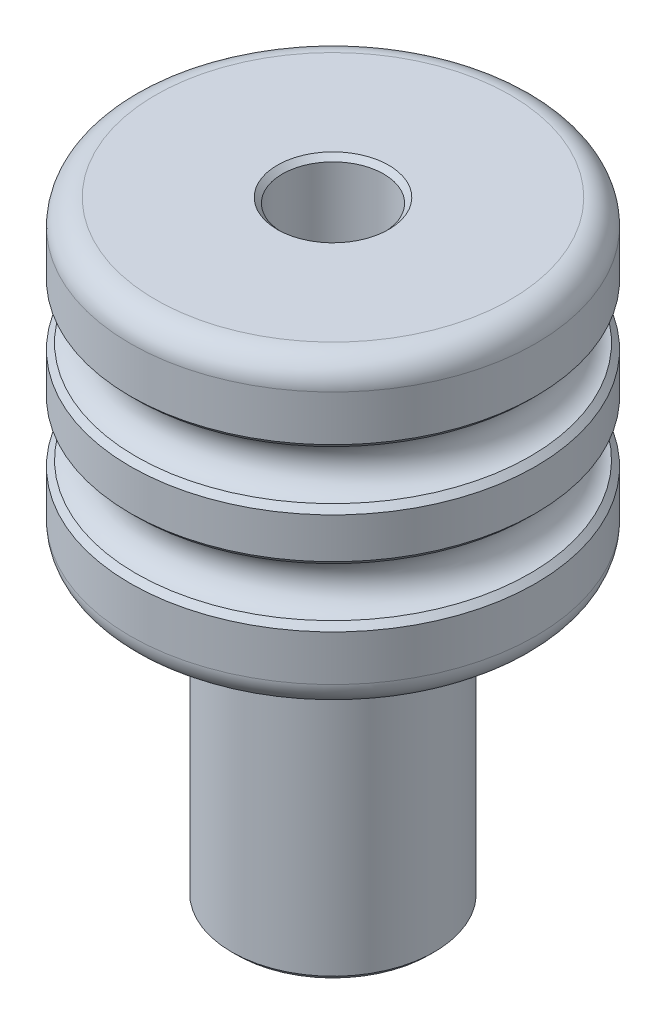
ISO-10303-21;
HEADER;
FILE_DESCRIPTION(('STEP AP214'),'2;1');
FILE_NAME('part.step','',(''),(''),'','','');
FILE_SCHEMA(('AUTOMOTIVE_DESIGN { 1 0 10303 214 1 1 1 1 }'));
ENDSEC;
DATA;
#1=APPLICATION_CONTEXT('core data for automotive mechanical design processes');
#2=APPLICATION_PROTOCOL_DEFINITION('international standard','automotive_design',2000,#1);
#3=PRODUCT_CONTEXT('',#1,'mechanical');
#4=PRODUCT('Part','Part','',(#3));
#5=PRODUCT_RELATED_PRODUCT_CATEGORY('part','',(#4));
#6=PRODUCT_DEFINITION_FORMATION('','',#4);
#7=PRODUCT_DEFINITION_CONTEXT('part definition',#1,'design');
#8=PRODUCT_DEFINITION('design','',#6,#7);
#9=PRODUCT_DEFINITION_SHAPE('','',#8);
#10=(LENGTH_UNIT() NAMED_UNIT(*) SI_UNIT(.MILLI.,.METRE.));
#11=(NAMED_UNIT(*) PLANE_ANGLE_UNIT() SI_UNIT($,.RADIAN.));
#12=(NAMED_UNIT(*) SI_UNIT($,.STERADIAN.) SOLID_ANGLE_UNIT());
#13=UNCERTAINTY_MEASURE_WITH_UNIT(LENGTH_MEASURE(1.E-05),#10,'distance_accuracy_value','');
#14=(GEOMETRIC_REPRESENTATION_CONTEXT(3) GLOBAL_UNCERTAINTY_ASSIGNED_CONTEXT((#13)) GLOBAL_UNIT_ASSIGNED_CONTEXT((#10,
#11,#12)) REPRESENTATION_CONTEXT('',''));
#15=CARTESIAN_POINT('',(0.,0.,0.));
#16=DIRECTION('',(0.,0.,1.));
#17=DIRECTION('',(1.,0.,0.));
#18=AXIS2_PLACEMENT_3D('',#15,#16,#17);
#19=CARTESIAN_POINT('',(0.,0.,-2.));
#20=DIRECTION('',(0.,-1.,0.));
#21=DIRECTION('',(0.,0.,-1.));
#22=AXIS2_PLACEMENT_3D('',#19,#20,#21);
#23=PLANE('',#22);
#24=CARTESIAN_POINT('',(0.,0.,0.));
#25=DIRECTION('',(0.,-1.,0.));
#26=DIRECTION('',(0.,0.,-1.));
#27=AXIS2_PLACEMENT_3D('',#24,#25,#26);
#28=CIRCLE('',#27,1.9);
#29=CARTESIAN_POINT('',(0.,0.,-1.9));
#30=VERTEX_POINT('',#29);
#31=EDGE_CURVE('E79',#30,#30,#28,.T.);
#32=ORIENTED_EDGE('',*,*,#31,.T.);
#33=EDGE_LOOP('',(#32));
#34=FACE_BOUND('',#33,.T.);
#35=CARTESIAN_POINT('',(0.,0.,0.));
#36=DIRECTION('',(0.,-1.,0.));
#37=DIRECTION('',(0.,0.,-1.));
#38=AXIS2_PLACEMENT_3D('',#35,#36,#37);
#39=CIRCLE('',#38,1.1);
#40=CARTESIAN_POINT('',(0.,0.,-1.1));
#41=VERTEX_POINT('',#40);
#42=EDGE_CURVE('E82',#41,#41,#39,.F.);
#43=ORIENTED_EDGE('',*,*,#42,.T.);
#44=EDGE_LOOP('',(#43));
#45=FACE_BOUND('',#44,.T.);
#46=ADVANCED_FACE('F29',(#34,#45),#23,.T.);
#47=CARTESIAN_POINT('',(0.,0.,0.));
#48=DIRECTION('',(0.,-1.,0.));
#49=DIRECTION('',(0.,0.,-1.));
#50=AXIS2_PLACEMENT_3D('',#47,#48,#49);
#51=CYLINDRICAL_SURFACE('',#50,1.);
#52=CARTESIAN_POINT('',(0.,11.9,0.));
#53=DIRECTION('',(0.,1.,0.));
#54=DIRECTION('',(0.,0.,1.));
#55=AXIS2_PLACEMENT_3D('',#52,#53,#54);
#56=CIRCLE('',#55,1.);
#57=CARTESIAN_POINT('',(0.,11.9,1.));
#58=VERTEX_POINT('',#57);
#59=EDGE_CURVE('E61',#58,#58,#56,.T.);
#60=ORIENTED_EDGE('',*,*,#59,.T.);
#61=EDGE_LOOP('',(#60));
#62=FACE_BOUND('',#61,.T.);
#63=CARTESIAN_POINT('',(0.,0.0999999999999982,0.));
#64=DIRECTION('',(0.,-1.,0.));
#65=DIRECTION('',(0.,0.,-1.));
#66=AXIS2_PLACEMENT_3D('',#63,#64,#65);
#67=CIRCLE('',#66,1.);
#68=CARTESIAN_POINT('',(0.,0.0999999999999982,-1.));
#69=VERTEX_POINT('',#68);
#70=EDGE_CURVE('E64',#69,#69,#67,.T.);
#71=ORIENTED_EDGE('',*,*,#70,.T.);
#72=EDGE_LOOP('',(#71));
#73=FACE_BOUND('',#72,.T.);
#74=ADVANCED_FACE('F116',(#62,#73),#51,.F.);
#75=CARTESIAN_POINT('',(0.,12.,-1.));
#76=DIRECTION('',(0.,1.,0.));
#77=DIRECTION('',(0.,0.,1.));
#78=AXIS2_PLACEMENT_3D('',#75,#76,#77);
#79=PLANE('',#78);
#80=CARTESIAN_POINT('',(0.,12.,0.));
#81=DIRECTION('',(0.,1.,0.));
#82=DIRECTION('',(0.,0.,1.));
#83=AXIS2_PLACEMENT_3D('',#80,#81,#82);
#84=CIRCLE('',#83,1.1);
#85=CARTESIAN_POINT('',(0.,12.,1.1));
#86=VERTEX_POINT('',#85);
#87=EDGE_CURVE('E67',#86,#86,#84,.F.);
#88=ORIENTED_EDGE('',*,*,#87,.T.);
#89=EDGE_LOOP('',(#88));
#90=FACE_BOUND('',#89,.T.);
#91=CARTESIAN_POINT('',(0.,12.,0.));
#92=DIRECTION('',(0.,-1.,0.));
#93=DIRECTION('',(0.,0.,-1.));
#94=AXIS2_PLACEMENT_3D('',#91,#92,#93);
#95=CIRCLE('',#94,3.5);
#96=CARTESIAN_POINT('',(0.,12.,-3.5));
#97=VERTEX_POINT('',#96);
#98=EDGE_CURVE('E85',#97,#97,#95,.T.);
#99=ORIENTED_EDGE('',*,*,#98,.F.);
#100=EDGE_LOOP('',(#99));
#101=FACE_BOUND('',#100,.T.);
#102=ADVANCED_FACE('F122',(#90,#101),#79,.T.);
#103=CARTESIAN_POINT('',(0.,11.5,0.));
#104=DIRECTION('',(0.,-1.,0.));
#105=DIRECTION('',(0.,0.,-1.));
#106=AXIS2_PLACEMENT_3D('',#103,#104,#105);
#107=TOROIDAL_SURFACE('',#106,3.5,0.5);
#108=ORIENTED_EDGE('',*,*,#98,.T.);
#109=EDGE_LOOP('',(#108));
#110=FACE_BOUND('',#109,.T.);
#111=CARTESIAN_POINT('',(0.,11.5,0.));
#112=DIRECTION('',(0.,-1.,0.));
#113=DIRECTION('',(0.,0.,-1.));
#114=AXIS2_PLACEMENT_3D('',#111,#112,#113);
#115=CIRCLE('',#114,4.);
#116=CARTESIAN_POINT('',(0.,11.5,-4.));
#117=VERTEX_POINT('',#116);
#118=EDGE_CURVE('E88',#117,#117,#115,.T.);
#119=ORIENTED_EDGE('',*,*,#118,.F.);
#120=EDGE_LOOP('',(#119));
#121=FACE_BOUND('',#120,.T.);
#122=ADVANCED_FACE('F177',(#110,#121),#107,.T.);
#123=CARTESIAN_POINT('',(0.,0.,0.));
#124=DIRECTION('',(0.,-1.,0.));
#125=DIRECTION('',(0.,0.,-1.));
#126=AXIS2_PLACEMENT_3D('',#123,#124,#125);
#127=CYLINDRICAL_SURFACE('',#126,4.);
#128=CARTESIAN_POINT('',(0.,10.6,0.));
#129=DIRECTION('',(0.,-1.,0.));
#130=DIRECTION('',(0.,0.,-1.));
#131=AXIS2_PLACEMENT_3D('',#128,#129,#130);
#132=CIRCLE('',#131,4.);
#133=CARTESIAN_POINT('',(0.,10.6,-4.));
#134=VERTEX_POINT('',#133);
#135=EDGE_CURVE('E10',#134,#134,#132,.F.);
#136=ORIENTED_EDGE('',*,*,#135,.T.);
#137=EDGE_LOOP('',(#136));
#138=FACE_BOUND('',#137,.T.);
#139=ORIENTED_EDGE('',*,*,#118,.T.);
#140=EDGE_LOOP('',(#139));
#141=FACE_BOUND('',#140,.T.);
#142=ADVANCED_FACE('F172',(#138,#141),#127,.T.);
#143=CARTESIAN_POINT('',(0.,10.,0.));
#144=DIRECTION('',(0.,-1.,0.));
#145=DIRECTION('',(0.,0.,-1.));
#146=AXIS2_PLACEMENT_3D('',#143,#144,#145);
#147=TOROIDAL_SURFACE('',#146,4.,0.5);
#148=CARTESIAN_POINT('',(0.,9.51291713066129,0.));
#149=DIRECTION('',(0.,1.,0.));
#150=DIRECTION('',(0.,0.,1.));
#151=AXIS2_PLACEMENT_3D('',#148,#149,#150);
#152=CIRCLE('',#151,3.88708286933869);
#153=CARTESIAN_POINT('',(0.,9.51291713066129,3.88708286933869));
#154=VERTEX_POINT('',#153);
#155=EDGE_CURVE('E36',#154,#154,#152,.T.);
#156=ORIENTED_EDGE('',*,*,#155,.T.);
#157=EDGE_LOOP('',(#156));
#158=FACE_BOUND('',#157,.T.);
#159=CARTESIAN_POINT('',(0.,10.4870828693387,0.));
#160=DIRECTION('',(0.,-1.,0.));
#161=DIRECTION('',(0.,0.,-1.));
#162=AXIS2_PLACEMENT_3D('',#159,#160,#161);
#163=CIRCLE('',#162,3.88708286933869);
#164=CARTESIAN_POINT('',(0.,10.4870828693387,-3.88708286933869));
#165=VERTEX_POINT('',#164);
#166=EDGE_CURVE('E40',#165,#165,#163,.T.);
#167=ORIENTED_EDGE('',*,*,#166,.T.);
#168=EDGE_LOOP('',(#167));
#169=FACE_BOUND('',#168,.T.);
#170=ADVANCED_FACE('F163',(#158,#169),#147,.F.);
#171=CARTESIAN_POINT('',(0.,0.,0.));
#172=DIRECTION('',(0.,-1.,0.));
#173=DIRECTION('',(0.,0.,-1.));
#174=AXIS2_PLACEMENT_3D('',#171,#172,#173);
#175=CYLINDRICAL_SURFACE('',#174,4.);
#176=CARTESIAN_POINT('',(0.,8.6,0.));
#177=DIRECTION('',(0.,-1.,0.));
#178=DIRECTION('',(0.,0.,-1.));
#179=AXIS2_PLACEMENT_3D('',#176,#177,#178);
#180=CIRCLE('',#179,4.);
#181=CARTESIAN_POINT('',(0.,8.6,4.));
#182=VERTEX_POINT('',#181);
#183=EDGE_CURVE('E44',#182,#182,#180,.F.);
#184=ORIENTED_EDGE('',*,*,#183,.T.);
#185=EDGE_LOOP('',(#184));
#186=FACE_BOUND('',#185,.T.);
#187=CARTESIAN_POINT('',(0.,9.4,0.));
#188=DIRECTION('',(0.,1.,0.));
#189=DIRECTION('',(0.,0.,1.));
#190=AXIS2_PLACEMENT_3D('',#187,#188,#189);
#191=CIRCLE('',#190,4.);
#192=CARTESIAN_POINT('',(0.,9.4,4.));
#193=VERTEX_POINT('',#192);
#194=EDGE_CURVE('E49',#193,#193,#191,.F.);
#195=ORIENTED_EDGE('',*,*,#194,.T.);
#196=EDGE_LOOP('',(#195));
#197=FACE_BOUND('',#196,.T.);
#198=ADVANCED_FACE('F161',(#186,#197),#175,.T.);
#199=CARTESIAN_POINT('',(0.,8.,0.));
#200=DIRECTION('',(0.,-1.,0.));
#201=DIRECTION('',(0.,0.,-1.));
#202=AXIS2_PLACEMENT_3D('',#199,#200,#201);
#203=TOROIDAL_SURFACE('',#202,4.,0.5);
#204=CARTESIAN_POINT('',(0.,7.51291713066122,0.));
#205=DIRECTION('',(0.,1.,0.));
#206=DIRECTION('',(0.,0.,1.));
#207=AXIS2_PLACEMENT_3D('',#204,#205,#206);
#208=CIRCLE('',#207,3.88708286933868);
#209=CARTESIAN_POINT('',(0.,7.51291713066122,3.88708286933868));
#210=VERTEX_POINT('',#209);
#211=EDGE_CURVE('E52',#210,#210,#208,.T.);
#212=ORIENTED_EDGE('',*,*,#211,.T.);
#213=EDGE_LOOP('',(#212));
#214=FACE_BOUND('',#213,.T.);
#215=CARTESIAN_POINT('',(0.,8.48708286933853,0.));
#216=DIRECTION('',(0.,-1.,0.));
#217=DIRECTION('',(0.,0.,-1.));
#218=AXIS2_PLACEMENT_3D('',#215,#216,#217);
#219=CIRCLE('',#218,3.88708286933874);
#220=CARTESIAN_POINT('',(0.,8.48708286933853,3.88708286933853));
#221=VERTEX_POINT('',#220);
#222=EDGE_CURVE('E55',#221,#221,#219,.T.);
#223=ORIENTED_EDGE('',*,*,#222,.T.);
#224=EDGE_LOOP('',(#223));
#225=FACE_BOUND('',#224,.T.);
#226=ADVANCED_FACE('F112',(#214,#225),#203,.F.);
#227=CARTESIAN_POINT('',(0.,0.,0.));
#228=DIRECTION('',(0.,-1.,0.));
#229=DIRECTION('',(0.,0.,-1.));
#230=AXIS2_PLACEMENT_3D('',#227,#228,#229);
#231=CYLINDRICAL_SURFACE('',#230,4.);
#232=CARTESIAN_POINT('',(0.,7.4,0.));
#233=DIRECTION('',(0.,1.,0.));
#234=DIRECTION('',(0.,0.,1.));
#235=AXIS2_PLACEMENT_3D('',#232,#233,#234);
#236=CIRCLE('',#235,4.);
#237=CARTESIAN_POINT('',(0.,7.4,4.));
#238=VERTEX_POINT('',#237);
#239=EDGE_CURVE('E58',#238,#238,#236,.F.);
#240=ORIENTED_EDGE('',*,*,#239,.T.);
#241=EDGE_LOOP('',(#240));
#242=FACE_BOUND('',#241,.T.);
#243=CARTESIAN_POINT('',(0.,6.5,0.));
#244=DIRECTION('',(0.,-1.,0.));
#245=DIRECTION('',(0.,0.,-1.));
#246=AXIS2_PLACEMENT_3D('',#243,#244,#245);
#247=CIRCLE('',#246,4.);
#248=CARTESIAN_POINT('',(0.,6.5,-4.));
#249=VERTEX_POINT('',#248);
#250=EDGE_CURVE('E91',#249,#249,#247,.T.);
#251=ORIENTED_EDGE('',*,*,#250,.F.);
#252=EDGE_LOOP('',(#251));
#253=FACE_BOUND('',#252,.T.);
#254=ADVANCED_FACE('F102',(#242,#253),#231,.T.);
#255=CARTESIAN_POINT('',(0.,6.5,0.));
#256=DIRECTION('',(0.,-1.,0.));
#257=DIRECTION('',(0.,0.,-1.));
#258=AXIS2_PLACEMENT_3D('',#255,#256,#257);
#259=TOROIDAL_SURFACE('',#258,3.5,0.5);
#260=ORIENTED_EDGE('',*,*,#250,.T.);
#261=EDGE_LOOP('',(#260));
#262=FACE_BOUND('',#261,.T.);
#263=CARTESIAN_POINT('',(0.,6.,0.));
#264=DIRECTION('',(0.,-1.,0.));
#265=DIRECTION('',(0.,0.,-1.));
#266=AXIS2_PLACEMENT_3D('',#263,#264,#265);
#267=CIRCLE('',#266,3.5);
#268=CARTESIAN_POINT('',(0.,6.,-3.5));
#269=VERTEX_POINT('',#268);
#270=EDGE_CURVE('E94',#269,#269,#267,.T.);
#271=ORIENTED_EDGE('',*,*,#270,.F.);
#272=EDGE_LOOP('',(#271));
#273=FACE_BOUND('',#272,.T.);
#274=ADVANCED_FACE('F100',(#262,#273),#259,.T.);
#275=CARTESIAN_POINT('',(0.,6.,-3.5));
#276=DIRECTION('',(0.,-1.,0.));
#277=DIRECTION('',(0.,0.,-1.));
#278=AXIS2_PLACEMENT_3D('',#275,#276,#277);
#279=PLANE('',#278);
#280=CARTESIAN_POINT('',(0.,6.,0.));
#281=DIRECTION('',(0.,-1.,0.));
#282=DIRECTION('',(0.,0.,-1.));
#283=AXIS2_PLACEMENT_3D('',#280,#281,#282);
#284=CIRCLE('',#283,2.1);
#285=CARTESIAN_POINT('',(0.,6.,-2.1));
#286=VERTEX_POINT('',#285);
#287=EDGE_CURVE('E70',#286,#286,#284,.F.);
#288=ORIENTED_EDGE('',*,*,#287,.T.);
#289=EDGE_LOOP('',(#288));
#290=FACE_BOUND('',#289,.T.);
#291=ORIENTED_EDGE('',*,*,#270,.T.);
#292=EDGE_LOOP('',(#291));
#293=FACE_BOUND('',#292,.T.);
#294=ADVANCED_FACE('F98',(#290,#293),#279,.T.);
#295=CARTESIAN_POINT('',(0.,0.,0.));
#296=DIRECTION('',(0.,-1.,0.));
#297=DIRECTION('',(0.,0.,-1.));
#298=AXIS2_PLACEMENT_3D('',#295,#296,#297);
#299=CYLINDRICAL_SURFACE('',#298,2.);
#300=CARTESIAN_POINT('',(0.,0.100000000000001,0.));
#301=DIRECTION('',(0.,-1.,0.));
#302=DIRECTION('',(0.,0.,-1.));
#303=AXIS2_PLACEMENT_3D('',#300,#301,#302);
#304=CIRCLE('',#303,2.);
#305=CARTESIAN_POINT('',(0.,0.100000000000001,-2.));
#306=VERTEX_POINT('',#305);
#307=EDGE_CURVE('E73',#306,#306,#304,.F.);
#308=ORIENTED_EDGE('',*,*,#307,.T.);
#309=EDGE_LOOP('',(#308));
#310=FACE_BOUND('',#309,.T.);
#311=CARTESIAN_POINT('',(0.,5.9,0.));
#312=DIRECTION('',(0.,-1.,0.));
#313=DIRECTION('',(0.,0.,-1.));
#314=AXIS2_PLACEMENT_3D('',#311,#312,#313);
#315=CIRCLE('',#314,2.);
#316=CARTESIAN_POINT('',(0.,5.9,-2.));
#317=VERTEX_POINT('',#316);
#318=EDGE_CURVE('E76',#317,#317,#315,.T.);
#319=ORIENTED_EDGE('',*,*,#318,.T.);
#320=EDGE_LOOP('',(#319));
#321=FACE_BOUND('',#320,.T.);
#322=ADVANCED_FACE('F109',(#310,#321),#299,.T.);
#323=CARTESIAN_POINT('',(0.,0.,0.));
#324=DIRECTION('',(0.,1.,0.));
#325=DIRECTION('',(0.,0.,1.));
#326=AXIS2_PLACEMENT_3D('',#323,#324,#325);
#327=CONICAL_SURFACE('',#326,1.9,0.78539816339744);
#328=ORIENTED_EDGE('',*,*,#307,.F.);
#329=EDGE_LOOP('',(#328));
#330=FACE_BOUND('',#329,.T.);
#331=ORIENTED_EDGE('',*,*,#31,.F.);
#332=EDGE_LOOP('',(#331));
#333=FACE_BOUND('',#332,.T.);
#334=ADVANCED_FACE('F128',(#330,#333),#327,.T.);
#335=CARTESIAN_POINT('',(0.,5.9,0.));
#336=DIRECTION('',(0.,1.,0.));
#337=DIRECTION('',(0.,0.,1.));
#338=AXIS2_PLACEMENT_3D('',#335,#336,#337);
#339=CONICAL_SURFACE('',#338,2.,0.78539816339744);
#340=ORIENTED_EDGE('',*,*,#287,.F.);
#341=EDGE_LOOP('',(#340));
#342=FACE_BOUND('',#341,.T.);
#343=ORIENTED_EDGE('',*,*,#318,.F.);
#344=EDGE_LOOP('',(#343));
#345=FACE_BOUND('',#344,.T.);
#346=ADVANCED_FACE('F131',(#342,#345),#339,.T.);
#347=CARTESIAN_POINT('',(0.,12.,0.));
#348=DIRECTION('',(0.,1.,0.));
#349=DIRECTION('',(0.,0.,1.));
#350=AXIS2_PLACEMENT_3D('',#347,#348,#349);
#351=CONICAL_SURFACE('',#350,1.1,0.785398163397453);
#352=ORIENTED_EDGE('',*,*,#59,.F.);
#353=EDGE_LOOP('',(#352));
#354=FACE_BOUND('',#353,.T.);
#355=ORIENTED_EDGE('',*,*,#87,.F.);
#356=EDGE_LOOP('',(#355));
#357=FACE_BOUND('',#356,.T.);
#358=ADVANCED_FACE('F135',(#354,#357),#351,.F.);
#359=CARTESIAN_POINT('',(0.,0.0999999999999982,0.));
#360=DIRECTION('',(0.,-1.,0.));
#361=DIRECTION('',(0.,0.,-1.));
#362=AXIS2_PLACEMENT_3D('',#359,#360,#361);
#363=CONICAL_SURFACE('',#362,1.,0.785398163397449);
#364=ORIENTED_EDGE('',*,*,#42,.F.);
#365=EDGE_LOOP('',(#364));
#366=FACE_BOUND('',#365,.T.);
#367=ORIENTED_EDGE('',*,*,#70,.F.);
#368=EDGE_LOOP('',(#367));
#369=FACE_BOUND('',#368,.T.);
#370=ADVANCED_FACE('F139',(#366,#369),#363,.F.);
#371=CARTESIAN_POINT('',(0.,7.4,0.));
#372=DIRECTION('',(0.,-1.,0.));
#373=DIRECTION('',(0.,0.,-1.));
#374=AXIS2_PLACEMENT_3D('',#371,#372,#373);
#375=CONICAL_SURFACE('',#374,4.,0.785398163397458);
#376=ORIENTED_EDGE('',*,*,#211,.F.);
#377=EDGE_LOOP('',(#376));
#378=FACE_BOUND('',#377,.T.);
#379=ORIENTED_EDGE('',*,*,#239,.F.);
#380=EDGE_LOOP('',(#379));
#381=FACE_BOUND('',#380,.T.);
#382=ADVANCED_FACE('F143',(#378,#381),#375,.T.);
#383=CARTESIAN_POINT('',(0.,8.4870828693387,0.));
#384=DIRECTION('',(0.,1.,0.));
#385=DIRECTION('',(0.,0.,1.));
#386=AXIS2_PLACEMENT_3D('',#383,#384,#385);
#387=CONICAL_SURFACE('',#386,3.8870828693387,0.78539816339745);
#388=CARTESIAN_POINT('',(0.,8.6,4.));
#389=CARTESIAN_POINT('',(0.,8.59882377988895,3.99882377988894));
#390=CARTESIAN_POINT('',(0.,8.59764755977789,3.99764755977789));
#391=CARTESIAN_POINT('',(0.,8.59529511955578,3.99529511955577));
#392=CARTESIAN_POINT('',(0.,8.59411889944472,3.99411889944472));
#393=CARTESIAN_POINT('',(0.,8.5917664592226,3.9917664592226));
#394=CARTESIAN_POINT('',(0.,8.59059023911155,3.99059023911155));
#395=CARTESIAN_POINT('',(0.,8.58823779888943,3.98823779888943));
#396=CARTESIAN_POINT('',(0.,8.58706157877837,3.98706157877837));
#397=CARTESIAN_POINT('',(0.,8.58470913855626,3.98470913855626));
#398=CARTESIAN_POINT('',(0.,8.5835329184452,3.9835329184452));
#399=CARTESIAN_POINT('',(0.,8.58118047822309,3.98118047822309));
#400=CARTESIAN_POINT('',(0.,8.58000425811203,3.98000425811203));
#401=CARTESIAN_POINT('',(0.,8.57765181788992,3.97765181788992));
#402=CARTESIAN_POINT('',(0.,8.57647559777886,3.97647559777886));
#403=CARTESIAN_POINT('',(0.,8.57412315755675,3.97412315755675));
#404=CARTESIAN_POINT('',(0.,8.57294693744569,3.97294693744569));
#405=CARTESIAN_POINT('',(0.,8.57059449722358,3.97059449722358));
#406=CARTESIAN_POINT('',(0.,8.56941827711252,3.96941827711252));
#407=CARTESIAN_POINT('',(0.,8.56706583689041,3.96706583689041));
#408=CARTESIAN_POINT('',(0.,8.56588961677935,3.96588961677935));
#409=CARTESIAN_POINT('',(0.,8.56353717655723,3.96353717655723));
#410=CARTESIAN_POINT('',(0.,8.56236095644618,3.96236095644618));
#411=CARTESIAN_POINT('',(0.,8.56000851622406,3.96000851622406));
#412=CARTESIAN_POINT('',(0.,8.55883229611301,3.95883229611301));
#413=CARTESIAN_POINT('',(0.,8.55647985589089,3.95647985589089));
#414=CARTESIAN_POINT('',(0.,8.55530363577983,3.95530363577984));
#415=CARTESIAN_POINT('',(0.,8.55295119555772,3.95295119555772));
#416=CARTESIAN_POINT('',(0.,8.55177497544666,3.95177497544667));
#417=CARTESIAN_POINT('',(0.,8.54942253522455,3.94942253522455));
#418=CARTESIAN_POINT('',(0.,8.54824631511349,3.94824631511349));
#419=CARTESIAN_POINT('',(0.,8.54589387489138,3.94589387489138));
#420=CARTESIAN_POINT('',(0.,8.54471765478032,3.94471765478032));
#421=CARTESIAN_POINT('',(0.,8.54236521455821,3.94236521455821));
#422=CARTESIAN_POINT('',(0.,8.54118899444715,3.94118899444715));
#423=CARTESIAN_POINT('',(0.,8.53883655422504,3.93883655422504));
#424=CARTESIAN_POINT('',(0.,8.53766033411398,3.93766033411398));
#425=CARTESIAN_POINT('',(0.,8.53530789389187,3.93530789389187));
#426=CARTESIAN_POINT('',(0.,8.53413167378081,3.93413167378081));
#427=CARTESIAN_POINT('',(0.,8.5317792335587,3.9317792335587));
#428=CARTESIAN_POINT('',(0.,8.53060301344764,3.93060301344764));
#429=CARTESIAN_POINT('',(0.,8.52825057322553,3.92825057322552));
#430=CARTESIAN_POINT('',(0.,8.52707435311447,3.92707435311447));
#431=CARTESIAN_POINT('',(0.,8.52472191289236,3.92472191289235));
#432=CARTESIAN_POINT('',(0.,8.5235456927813,3.9235456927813));
#433=CARTESIAN_POINT('',(0.,8.52119325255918,3.92119325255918));
#434=CARTESIAN_POINT('',(0.,8.52001703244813,3.92001703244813));
#435=CARTESIAN_POINT('',(0.,8.51766459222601,3.91766459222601));
#436=CARTESIAN_POINT('',(0.,8.51648837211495,3.91648837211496));
#437=CARTESIAN_POINT('',(0.,8.51413593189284,3.91413593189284));
#438=CARTESIAN_POINT('',(0.,8.51295971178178,3.91295971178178));
#439=CARTESIAN_POINT('',(0.,8.51060727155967,3.91060727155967));
#440=CARTESIAN_POINT('',(0.,8.50943105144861,3.90943105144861));
#441=CARTESIAN_POINT('',(0.,8.5070786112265,3.9070786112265));
#442=CARTESIAN_POINT('',(0.,8.50590239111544,3.90590239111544));
#443=CARTESIAN_POINT('',(0.,8.50354995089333,3.90354995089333));
#444=CARTESIAN_POINT('',(0.,8.50237373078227,3.90237373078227));
#445=CARTESIAN_POINT('',(0.,8.50002129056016,3.90002129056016));
#446=CARTESIAN_POINT('',(0.,8.4988450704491,3.8988450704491));
#447=CARTESIAN_POINT('',(0.,8.49649263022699,3.89649263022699));
#448=CARTESIAN_POINT('',(0.,8.49531641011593,3.89531641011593));
#449=CARTESIAN_POINT('',(0.,8.49296396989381,3.89296396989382));
#450=CARTESIAN_POINT('',(0.,8.49178774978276,3.89178774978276));
#451=CARTESIAN_POINT('',(0.,8.48943530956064,3.88943530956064));
#452=CARTESIAN_POINT('',(0.,8.48825908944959,3.88825908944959));
#453=CARTESIAN_POINT('',(0.,8.48708286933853,3.88708286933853));
#454=B_SPLINE_CURVE_WITH_KNOTS('',3,(#388,#389,#390,#391,#392,#393,#394,#395,#396,#397,#398,
#399,#400,#401,#402,#403,#404,#405,#406,#407,#408,#409,#410,#411,#412,#413,#414,#415,#416,#417,
#418,#419,#420,#421,#422,#423,#424,#425,#426,#427,#428,#429,#430,#431,#432,#433,#434,#435,#436,
#437,#438,#439,#440,#441,#442,#443,#444,#445,#446,#447,#448,#449,#450,#451,#452,#453),
.UNSPECIFIED.,.F.,.F.,(4,2,2,2,2,2,2,2,2,2,2,2,2,2,2,2,2,2,2,2,2,2,2,2,2,2,2,2,2,2,2,2,4),(0.,
0.00499027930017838,0.00998055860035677,0.0149708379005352,0.0199611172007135,
0.0249513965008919,0.0299416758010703,0.0349319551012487,0.0399222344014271,0.0449125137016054,
0.0499027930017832,0.0548930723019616,0.05988335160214,0.0648736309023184,0.0698639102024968,
0.0748541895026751,0.0798444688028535,0.0848347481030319,0.0898250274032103,0.0948153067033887,
0.099805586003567,0.104795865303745,0.109786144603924,0.114776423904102,0.119766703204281,
0.124756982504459,0.129747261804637,0.134737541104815,0.139727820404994,0.144718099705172,
0.149708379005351,0.154698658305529,0.159688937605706),.UNSPECIFIED.);
#455=EDGE_CURVE('BSEAM147',#182,#221,#454,.T.);
#456=ORIENTED_EDGE('',*,*,#183,.F.);
#457=ORIENTED_EDGE('',*,*,#222,.F.);
#458=ORIENTED_EDGE('',*,*,#455,.T.);
#459=ORIENTED_EDGE('',*,*,#455,.F.);
#460=EDGE_LOOP('',(#456,#458,#457,#459));
#461=FACE_BOUND('',#460,.T.);
#462=ADVANCED_FACE('F147',(#461),#387,.T.);
#463=CARTESIAN_POINT('',(0.,9.4,0.));
#464=DIRECTION('',(0.,-1.,0.));
#465=DIRECTION('',(0.,0.,-1.));
#466=AXIS2_PLACEMENT_3D('',#463,#464,#465);
#467=CONICAL_SURFACE('',#466,4.,0.785398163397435);
#468=ORIENTED_EDGE('',*,*,#155,.F.);
#469=EDGE_LOOP('',(#468));
#470=FACE_BOUND('',#469,.T.);
#471=ORIENTED_EDGE('',*,*,#194,.F.);
#472=EDGE_LOOP('',(#471));
#473=FACE_BOUND('',#472,.T.);
#474=ADVANCED_FACE('F150',(#470,#473),#467,.T.);
#475=CARTESIAN_POINT('',(0.,10.4870828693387,0.));
#476=DIRECTION('',(0.,1.,0.));
#477=DIRECTION('',(0.,0.,1.));
#478=AXIS2_PLACEMENT_3D('',#475,#476,#477);
#479=CONICAL_SURFACE('',#478,3.88708286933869,0.785398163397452);
#480=ORIENTED_EDGE('',*,*,#135,.F.);
#481=EDGE_LOOP('',(#480));
#482=FACE_BOUND('',#481,.T.);
#483=ORIENTED_EDGE('',*,*,#166,.F.);
#484=EDGE_LOOP('',(#483));
#485=FACE_BOUND('',#484,.T.);
#486=ADVANCED_FACE('F31',(#482,#485),#479,.T.);
#487=CLOSED_SHELL('',(#46,#74,#102,#122,#142,#170,#198,#226,#254,#274,#294,#322,#334,#346,#358,
#370,#382,#462,#474,#486));
#488=MANIFOLD_SOLID_BREP('B2',#487);
#489=ADVANCED_BREP_SHAPE_REPRESENTATION('',(#18,#488),#14);
#490=SHAPE_DEFINITION_REPRESENTATION(#9,#489);
ENDSEC;
END-ISO-10303-21;
